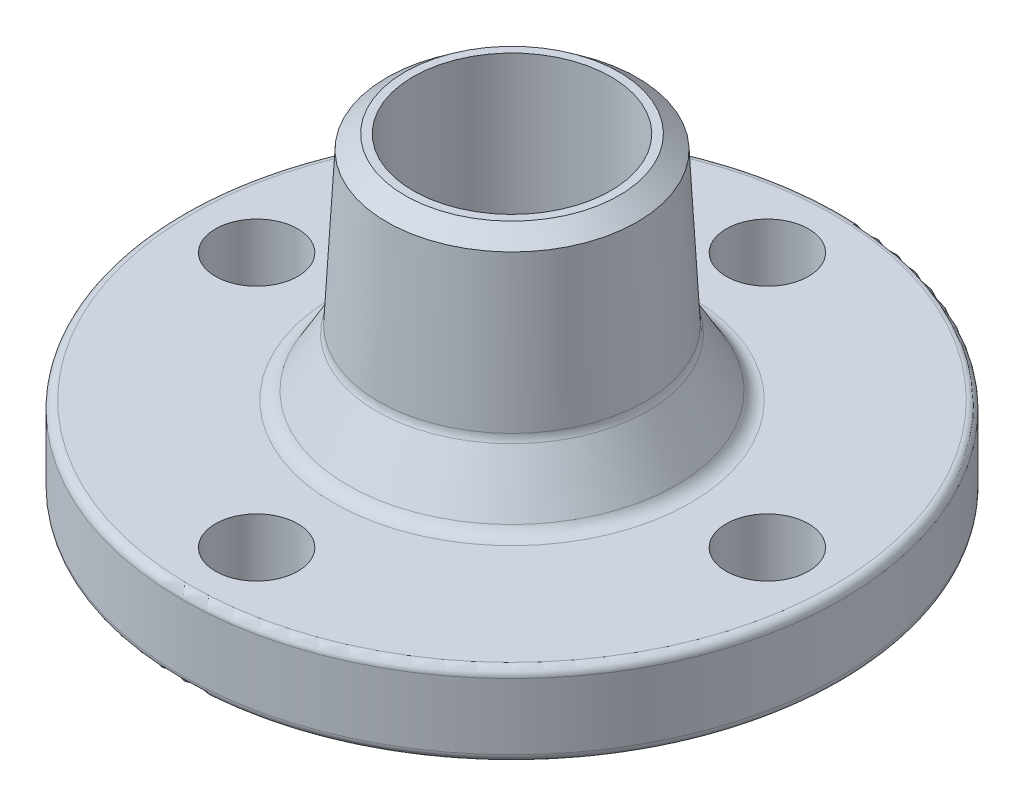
ISO-10303-21;
HEADER;
FILE_DESCRIPTION(('STEP AP214'),'2;1');
FILE_NAME('part.step','',(''),(''),'','','');
FILE_SCHEMA(('AUTOMOTIVE_DESIGN { 1 0 10303 214 1 1 1 1 }'));
ENDSEC;
DATA;
#1=APPLICATION_CONTEXT('core data for automotive mechanical design processes');
#2=APPLICATION_PROTOCOL_DEFINITION('international standard','automotive_design',2000,#1);
#3=PRODUCT_CONTEXT('',#1,'mechanical');
#4=PRODUCT('Part','Part','',(#3));
#5=PRODUCT_RELATED_PRODUCT_CATEGORY('part','',(#4));
#6=PRODUCT_DEFINITION_FORMATION('','',#4);
#7=PRODUCT_DEFINITION_CONTEXT('part definition',#1,'design');
#8=PRODUCT_DEFINITION('design','',#6,#7);
#9=PRODUCT_DEFINITION_SHAPE('','',#8);
#10=(LENGTH_UNIT() NAMED_UNIT(*) SI_UNIT(.MILLI.,.METRE.));
#11=(NAMED_UNIT(*) PLANE_ANGLE_UNIT() SI_UNIT($,.RADIAN.));
#12=(NAMED_UNIT(*) SI_UNIT($,.STERADIAN.) SOLID_ANGLE_UNIT());
#13=UNCERTAINTY_MEASURE_WITH_UNIT(LENGTH_MEASURE(1.E-05),#10,'distance_accuracy_value','');
#14=(GEOMETRIC_REPRESENTATION_CONTEXT(3) GLOBAL_UNCERTAINTY_ASSIGNED_CONTEXT((#13)) GLOBAL_UNIT_ASSIGNED_CONTEXT((#10,
#11,#12)) REPRESENTATION_CONTEXT('',''));
#15=CARTESIAN_POINT('',(0.,0.,0.));
#16=DIRECTION('',(0.,0.,1.));
#17=DIRECTION('',(1.,0.,0.));
#18=AXIS2_PLACEMENT_3D('',#15,#16,#17);
#19=CARTESIAN_POINT('',(19.05,0.,0.));
#20=DIRECTION('',(0.,1.,0.));
#21=DIRECTION('',(-1.,0.,0.));
#22=AXIS2_PLACEMENT_3D('',#19,#20,#21);
#23=PLANE('',#22);
#24=CARTESIAN_POINT('',(0.,0.,0.));
#25=DIRECTION('',(0.,1.,0.));
#26=DIRECTION('',(-1.,0.,0.));
#27=AXIS2_PLACEMENT_3D('',#24,#25,#26);
#28=CIRCLE('',#27,36.5125);
#29=CARTESIAN_POINT('',(-36.5125,0.,0.));
#30=VERTEX_POINT('',#29);
#31=EDGE_CURVE('E66',#30,#30,#28,.T.);
#32=ORIENTED_EDGE('',*,*,#31,.F.);
#33=EDGE_LOOP('',(#32));
#34=FACE_BOUND('',#33,.T.);
#35=CARTESIAN_POINT('',(0.,0.,0.));
#36=DIRECTION('',(0.,1.,0.));
#37=DIRECTION('',(-1.,0.,0.));
#38=AXIS2_PLACEMENT_3D('',#35,#36,#37);
#39=CIRCLE('',#38,19.05);
#40=CARTESIAN_POINT('',(-19.05,0.,0.));
#41=VERTEX_POINT('',#40);
#42=EDGE_CURVE('E70',#41,#41,#39,.T.);
#43=ORIENTED_EDGE('',*,*,#42,.T.);
#44=EDGE_LOOP('',(#43));
#45=FACE_BOUND('',#44,.T.);
#46=ADVANCED_FACE('F31',(#34,#45),#23,.F.);
#47=CARTESIAN_POINT('',(36.5125,1.5875,0.));
#48=DIRECTION('',(0.,1.,0.));
#49=DIRECTION('',(-1.,0.,0.));
#50=AXIS2_PLACEMENT_3D('',#47,#48,#49);
#51=PLANE('',#50);
#52=CARTESIAN_POINT('',(0.,1.58749999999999,0.));
#53=DIRECTION('',(0.,1.,0.));
#54=DIRECTION('',(-1.,0.,0.));
#55=AXIS2_PLACEMENT_3D('',#52,#53,#54);
#56=CIRCLE('',#55,38.1);
#57=CARTESIAN_POINT('',(-38.1,1.58749999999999,0.));
#58=VERTEX_POINT('',#57);
#59=EDGE_CURVE('E10',#58,#58,#56,.T.);
#60=ORIENTED_EDGE('',*,*,#59,.T.);
#61=EDGE_LOOP('',(#60));
#62=FACE_BOUND('',#61,.T.);
#63=CARTESIAN_POINT('',(0.,1.58749999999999,0.));
#64=DIRECTION('',(0.,1.,0.));
#65=DIRECTION('',(-1.,0.,0.));
#66=AXIS2_PLACEMENT_3D('',#63,#64,#65);
#67=CIRCLE('',#66,61.9125);
#68=CARTESIAN_POINT('',(-61.9125,1.58749999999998,0.));
#69=VERTEX_POINT('',#68);
#70=EDGE_CURVE('E38',#69,#69,#67,.F.);
#71=ORIENTED_EDGE('',*,*,#70,.T.);
#72=EDGE_LOOP('',(#71));
#73=FACE_BOUND('',#72,.T.);
#74=CARTESIAN_POINT('',(5.15251089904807E-13,1.58749999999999,-49.2125));
#75=DIRECTION('',(0.,-1.,0.));
#76=DIRECTION('',(0.,0.,-1.));
#77=AXIS2_PLACEMENT_3D('',#74,#75,#76);
#78=CIRCLE('',#77,7.9375);
#79=CARTESIAN_POINT('',(5.98392037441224E-13,1.58749999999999,-57.15));
#80=VERTEX_POINT('',#79);
#81=EDGE_CURVE('E102',#80,#80,#78,.T.);
#82=ORIENTED_EDGE('',*,*,#81,.F.);
#83=EDGE_LOOP('',(#82));
#84=FACE_BOUND('',#83,.T.);
#85=CARTESIAN_POINT('',(-49.2125,1.58749999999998,-3.43649249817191E-13));
#86=DIRECTION('',(0.,-1.,0.));
#87=DIRECTION('',(-1.,0.,0.));
#88=AXIS2_PLACEMENT_3D('',#85,#86,#87);
#89=CIRCLE('',#88,7.9375);
#90=CARTESIAN_POINT('',(-57.15,1.58749999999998,-3.99076548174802E-13));
#91=VERTEX_POINT('',#90);
#92=EDGE_CURVE('E96',#91,#91,#89,.T.);
#93=ORIENTED_EDGE('',*,*,#92,.F.);
#94=EDGE_LOOP('',(#93));
#95=FACE_BOUND('',#94,.T.);
#96=CARTESIAN_POINT('',(-1.72047409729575E-13,1.58749999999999,49.2125));
#97=DIRECTION('',(0.,-1.,0.));
#98=DIRECTION('',(0.,0.,1.));
#99=AXIS2_PLACEMENT_3D('',#96,#97,#98);
#100=CIRCLE('',#99,7.9375);
#101=CARTESIAN_POINT('',(-1.9976105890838E-13,1.58749999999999,57.15));
#102=VERTEX_POINT('',#101);
#103=EDGE_CURVE('E90',#102,#102,#100,.T.);
#104=ORIENTED_EDGE('',*,*,#103,.F.);
#105=EDGE_LOOP('',(#104));
#106=FACE_BOUND('',#105,.T.);
#107=CARTESIAN_POINT('',(49.2125,1.5875,0.));
#108=DIRECTION('',(0.,-1.,0.));
#109=DIRECTION('',(1.,0.,0.));
#110=AXIS2_PLACEMENT_3D('',#107,#108,#109);
#111=CIRCLE('',#110,7.9375);
#112=CARTESIAN_POINT('',(57.15,1.5875,0.));
#113=VERTEX_POINT('',#112);
#114=EDGE_CURVE('E71',#113,#113,#111,.T.);
#115=ORIENTED_EDGE('',*,*,#114,.F.);
#116=EDGE_LOOP('',(#115));
#117=FACE_BOUND('',#116,.T.);
#118=ADVANCED_FACE('F109',(#62,#73,#84,#95,#106,#117),#51,.F.);
#119=CARTESIAN_POINT('',(0.,61.9125,0.));
#120=DIRECTION('',(0.,1.,0.));
#121=DIRECTION('',(-1.,0.,0.));
#122=AXIS2_PLACEMENT_3D('',#119,#120,#121);
#123=CYLINDRICAL_SURFACE('',#122,63.5);
#124=CARTESIAN_POINT('',(0.,15.875,0.));
#125=DIRECTION('',(0.,-1.,0.));
#126=DIRECTION('',(1.,0.,0.));
#127=AXIS2_PLACEMENT_3D('',#124,#125,#126);
#128=CIRCLE('',#127,63.5);
#129=CARTESIAN_POINT('',(63.5,15.875,0.));
#130=VERTEX_POINT('',#129);
#131=EDGE_CURVE('E42',#130,#130,#128,.T.);
#132=ORIENTED_EDGE('',*,*,#131,.T.);
#133=EDGE_LOOP('',(#132));
#134=FACE_BOUND('',#133,.T.);
#135=CARTESIAN_POINT('',(0.,3.17499999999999,0.));
#136=DIRECTION('',(0.,1.,0.));
#137=DIRECTION('',(-1.,0.,0.));
#138=AXIS2_PLACEMENT_3D('',#135,#136,#137);
#139=CIRCLE('',#138,63.5);
#140=CARTESIAN_POINT('',(-63.5,3.17499999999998,0.));
#141=VERTEX_POINT('',#140);
#142=EDGE_CURVE('E46',#141,#141,#139,.T.);
#143=ORIENTED_EDGE('',*,*,#142,.T.);
#144=EDGE_LOOP('',(#143));
#145=FACE_BOUND('',#144,.T.);
#146=ADVANCED_FACE('F112',(#134,#145),#123,.T.);
#147=CARTESIAN_POINT('',(63.5,17.4625,0.));
#148=DIRECTION('',(0.,-1.,0.));
#149=DIRECTION('',(1.,0.,0.));
#150=AXIS2_PLACEMENT_3D('',#147,#148,#149);
#151=PLANE('',#150);
#152=CARTESIAN_POINT('',(0.,17.4625,0.));
#153=DIRECTION('',(0.,-1.,0.));
#154=DIRECTION('',(1.,0.,0.));
#155=AXIS2_PLACEMENT_3D('',#152,#153,#154);
#156=CIRCLE('',#155,61.9125);
#157=CARTESIAN_POINT('',(61.9125,17.4625,0.));
#158=VERTEX_POINT('',#157);
#159=EDGE_CURVE('E51',#158,#158,#156,.F.);
#160=ORIENTED_EDGE('',*,*,#159,.T.);
#161=EDGE_LOOP('',(#160));
#162=FACE_BOUND('',#161,.T.);
#163=CARTESIAN_POINT('',(0.,17.4625,0.));
#164=DIRECTION('',(0.,-1.,0.));
#165=DIRECTION('',(1.,0.,0.));
#166=AXIS2_PLACEMENT_3D('',#163,#164,#165);
#167=CIRCLE('',#166,34.3768371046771);
#168=CARTESIAN_POINT('',(34.3768371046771,17.4625,0.));
#169=VERTEX_POINT('',#168);
#170=EDGE_CURVE('E60',#169,#169,#167,.T.);
#171=ORIENTED_EDGE('',*,*,#170,.T.);
#172=EDGE_LOOP('',(#171));
#173=FACE_BOUND('',#172,.T.);
#174=CARTESIAN_POINT('',(5.13023241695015E-13,17.4625,-49.2125));
#175=DIRECTION('',(0.,-1.,0.));
#176=DIRECTION('',(0.,0.,-1.));
#177=AXIS2_PLACEMENT_3D('',#174,#175,#176);
#178=CIRCLE('',#177,7.9375);
#179=CARTESIAN_POINT('',(5.96164189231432E-13,17.4625,-57.15));
#180=VERTEX_POINT('',#179);
#181=EDGE_CURVE('E99',#180,#180,#178,.T.);
#182=ORIENTED_EDGE('',*,*,#181,.T.);
#183=EDGE_LOOP('',(#182));
#184=FACE_BOUND('',#183,.T.);
#185=CARTESIAN_POINT('',(-49.2125,17.4625,-3.43649249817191E-13));
#186=DIRECTION('',(0.,-1.,0.));
#187=DIRECTION('',(-1.,0.,0.));
#188=AXIS2_PLACEMENT_3D('',#185,#186,#187);
#189=CIRCLE('',#188,7.9375);
#190=CARTESIAN_POINT('',(-57.15,17.4625,-3.99076548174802E-13));
#191=VERTEX_POINT('',#190);
#192=EDGE_CURVE('E93',#191,#191,#189,.T.);
#193=ORIENTED_EDGE('',*,*,#192,.T.);
#194=EDGE_LOOP('',(#193));
#195=FACE_BOUND('',#194,.T.);
#196=CARTESIAN_POINT('',(-1.74275257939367E-13,17.4625,49.2125));
#197=DIRECTION('',(0.,-1.,0.));
#198=DIRECTION('',(0.,0.,1.));
#199=AXIS2_PLACEMENT_3D('',#196,#197,#198);
#200=CIRCLE('',#199,7.9375);
#201=CARTESIAN_POINT('',(-2.01988907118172E-13,17.4625,57.15));
#202=VERTEX_POINT('',#201);
#203=EDGE_CURVE('E87',#202,#202,#200,.T.);
#204=ORIENTED_EDGE('',*,*,#203,.T.);
#205=EDGE_LOOP('',(#204));
#206=FACE_BOUND('',#205,.T.);
#207=CARTESIAN_POINT('',(49.2125,17.4625,0.));
#208=DIRECTION('',(0.,-1.,0.));
#209=DIRECTION('',(1.,0.,0.));
#210=AXIS2_PLACEMENT_3D('',#207,#208,#209);
#211=CIRCLE('',#210,7.9375);
#212=CARTESIAN_POINT('',(57.15,17.4625,0.));
#213=VERTEX_POINT('',#212);
#214=EDGE_CURVE('E67',#213,#213,#211,.T.);
#215=ORIENTED_EDGE('',*,*,#214,.T.);
#216=EDGE_LOOP('',(#215));
#217=FACE_BOUND('',#216,.T.);
#218=ADVANCED_FACE('F128',(#162,#173,#184,#195,#206,#217),#151,.F.);
#219=CARTESIAN_POINT('',(0.,17.4625,0.));
#220=DIRECTION('',(0.,-1.,0.));
#221=DIRECTION('',(1.,0.,0.));
#222=AXIS2_PLACEMENT_3D('',#219,#220,#221);
#223=CONICAL_SURFACE('',#222,32.54375,0.523598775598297);
#224=CARTESIAN_POINT('',(0.,28.6266583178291,0.));
#225=DIRECTION('',(0.,-1.,0.));
#226=DIRECTION('',(1.,0.,0.));
#227=AXIS2_PLACEMENT_3D('',#224,#225,#226);
#228=CIRCLE('',#227,26.0981201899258);
#229=CARTESIAN_POINT('',(26.0981201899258,28.6266583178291,0.));
#230=VERTEX_POINT('',#229);
#231=EDGE_CURVE('E54',#230,#230,#228,.T.);
#232=ORIENTED_EDGE('',*,*,#231,.T.);
#233=EDGE_LOOP('',(#232));
#234=FACE_BOUND('',#233,.T.);
#235=CARTESIAN_POINT('',(0.,19.05,0.));
#236=DIRECTION('',(0.,-1.,0.));
#237=DIRECTION('',(1.,0.,0.));
#238=AXIS2_PLACEMENT_3D('',#235,#236,#237);
#239=CIRCLE('',#238,31.6272064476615);
#240=CARTESIAN_POINT('',(31.6272064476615,19.05,0.));
#241=VERTEX_POINT('',#240);
#242=EDGE_CURVE('E63',#241,#241,#239,.F.);
#243=ORIENTED_EDGE('',*,*,#242,.T.);
#244=EDGE_LOOP('',(#243));
#245=FACE_BOUND('',#244,.T.);
#246=ADVANCED_FACE('F130',(#234,#245),#223,.T.);
#247=CARTESIAN_POINT('',(0.,29.2859118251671,0.));
#248=DIRECTION('',(0.,-1.,0.));
#249=DIRECTION('',(1.,0.,0.));
#250=AXIS2_PLACEMENT_3D('',#247,#248,#249);
#251=CONICAL_SURFACE('',#250,25.7175,0.0529612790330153);
#252=CARTESIAN_POINT('',(0.,30.0460848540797,0.));
#253=DIRECTION('',(0.,-1.,0.));
#254=DIRECTION('',(1.,0.,0.));
#255=AXIS2_PLACEMENT_3D('',#252,#253,#254);
#256=CIRCLE('',#255,25.6772025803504);
#257=CARTESIAN_POINT('',(25.6772025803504,30.0460848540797,0.));
#258=VERTEX_POINT('',#257);
#259=EDGE_CURVE('E57',#258,#258,#256,.F.);
#260=ORIENTED_EDGE('',*,*,#259,.T.);
#261=EDGE_LOOP('',(#260));
#262=FACE_BOUND('',#261,.T.);
#263=CARTESIAN_POINT('',(0.,59.2326104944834,0.));
#264=DIRECTION('',(0.,1.,0.));
#265=DIRECTION('',(-1.,0.,0.));
#266=AXIS2_PLACEMENT_3D('',#263,#264,#265);
#267=CIRCLE('',#266,24.13);
#268=CARTESIAN_POINT('',(-24.13,59.2326104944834,0.));
#269=VERTEX_POINT('',#268);
#270=EDGE_CURVE('E74',#269,#269,#267,.T.);
#271=ORIENTED_EDGE('',*,*,#270,.F.);
#272=EDGE_LOOP('',(#271));
#273=FACE_BOUND('',#272,.T.);
#274=ADVANCED_FACE('F137',(#262,#273),#251,.T.);
#275=CARTESIAN_POINT('',(0.,59.2326104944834,0.));
#276=DIRECTION('',(0.,-1.,0.));
#277=DIRECTION('',(1.,0.,0.));
#278=AXIS2_PLACEMENT_3D('',#275,#276,#277);
#279=CONICAL_SURFACE('',#278,24.13,0.916297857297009);
#280=CARTESIAN_POINT('',(0.,61.9125,0.));
#281=DIRECTION('',(0.,1.,0.));
#282=DIRECTION('',(-1.,0.,0.));
#283=AXIS2_PLACEMENT_3D('',#280,#281,#282);
#284=CIRCLE('',#283,20.6375);
#285=CARTESIAN_POINT('',(-20.6375,61.9125,0.));
#286=VERTEX_POINT('',#285);
#287=EDGE_CURVE('E77',#286,#286,#284,.T.);
#288=ORIENTED_EDGE('',*,*,#287,.F.);
#289=EDGE_LOOP('',(#288));
#290=FACE_BOUND('',#289,.T.);
#291=ORIENTED_EDGE('',*,*,#270,.T.);
#292=EDGE_LOOP('',(#291));
#293=FACE_BOUND('',#292,.T.);
#294=ADVANCED_FACE('F219',(#290,#293),#279,.T.);
#295=CARTESIAN_POINT('',(20.6375,61.9125,0.));
#296=DIRECTION('',(0.,-1.,0.));
#297=DIRECTION('',(1.,0.,0.));
#298=AXIS2_PLACEMENT_3D('',#295,#296,#297);
#299=PLANE('',#298);
#300=CARTESIAN_POINT('',(0.,61.9125,0.));
#301=DIRECTION('',(0.,1.,0.));
#302=DIRECTION('',(-1.,0.,0.));
#303=AXIS2_PLACEMENT_3D('',#300,#301,#302);
#304=CIRCLE('',#303,19.05);
#305=CARTESIAN_POINT('',(-19.05,61.9125,0.));
#306=VERTEX_POINT('',#305);
#307=EDGE_CURVE('E80',#306,#306,#304,.T.);
#308=ORIENTED_EDGE('',*,*,#307,.F.);
#309=EDGE_LOOP('',(#308));
#310=FACE_BOUND('',#309,.T.);
#311=ORIENTED_EDGE('',*,*,#287,.T.);
#312=EDGE_LOOP('',(#311));
#313=FACE_BOUND('',#312,.T.);
#314=ADVANCED_FACE('F274',(#310,#313),#299,.F.);
#315=CARTESIAN_POINT('',(0.,61.9125,0.));
#316=DIRECTION('',(0.,1.,0.));
#317=DIRECTION('',(-1.,0.,0.));
#318=AXIS2_PLACEMENT_3D('',#315,#316,#317);
#319=CYLINDRICAL_SURFACE('',#318,19.05);
#320=ORIENTED_EDGE('',*,*,#42,.F.);
#321=EDGE_LOOP('',(#320));
#322=FACE_BOUND('',#321,.T.);
#323=ORIENTED_EDGE('',*,*,#307,.T.);
#324=EDGE_LOOP('',(#323));
#325=FACE_BOUND('',#324,.T.);
#326=ADVANCED_FACE('F124',(#322,#325),#319,.F.);
#327=CARTESIAN_POINT('',(49.2125,61.9125,0.));
#328=DIRECTION('',(0.,-1.,0.));
#329=DIRECTION('',(1.,0.,0.));
#330=AXIS2_PLACEMENT_3D('',#327,#328,#329);
#331=CYLINDRICAL_SURFACE('',#330,7.9375);
#332=CARTESIAN_POINT('',(57.15,1.5875,0.));
#333=CARTESIAN_POINT('',(57.15,1.75286458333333,0.));
#334=CARTESIAN_POINT('',(57.15,1.91822916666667,0.));
#335=CARTESIAN_POINT('',(57.15,2.24895833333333,0.));
#336=CARTESIAN_POINT('',(57.15,2.41432291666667,0.));
#337=CARTESIAN_POINT('',(57.15,2.74505208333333,0.));
#338=CARTESIAN_POINT('',(57.15,2.91041666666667,0.));
#339=CARTESIAN_POINT('',(57.15,3.24114583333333,0.));
#340=CARTESIAN_POINT('',(57.15,3.40651041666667,0.));
#341=CARTESIAN_POINT('',(57.15,3.73723958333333,0.));
#342=CARTESIAN_POINT('',(57.15,3.90260416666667,0.));
#343=CARTESIAN_POINT('',(57.15,4.23333333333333,0.));
#344=CARTESIAN_POINT('',(57.15,4.39869791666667,0.));
#345=CARTESIAN_POINT('',(57.15,4.72942708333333,0.));
#346=CARTESIAN_POINT('',(57.15,4.89479166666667,0.));
#347=CARTESIAN_POINT('',(57.15,5.22552083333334,0.));
#348=CARTESIAN_POINT('',(57.15,5.39088541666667,0.));
#349=CARTESIAN_POINT('',(57.15,5.72161458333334,0.));
#350=CARTESIAN_POINT('',(57.15,5.88697916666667,0.));
#351=CARTESIAN_POINT('',(57.15,6.21770833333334,0.));
#352=CARTESIAN_POINT('',(57.15,6.38307291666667,0.));
#353=CARTESIAN_POINT('',(57.15,6.71380208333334,0.));
#354=CARTESIAN_POINT('',(57.15,6.87916666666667,0.));
#355=CARTESIAN_POINT('',(57.15,7.20989583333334,0.));
#356=CARTESIAN_POINT('',(57.15,7.37526041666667,0.));
#357=CARTESIAN_POINT('',(57.15,7.70598958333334,0.));
#358=CARTESIAN_POINT('',(57.15,7.87135416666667,0.));
#359=CARTESIAN_POINT('',(57.15,8.20208333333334,0.));
#360=CARTESIAN_POINT('',(57.15,8.36744791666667,0.));
#361=CARTESIAN_POINT('',(57.15,8.69817708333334,0.));
#362=CARTESIAN_POINT('',(57.15,8.86354166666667,0.));
#363=CARTESIAN_POINT('',(57.15,9.19427083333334,0.));
#364=CARTESIAN_POINT('',(57.15,9.35963541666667,0.));
#365=CARTESIAN_POINT('',(57.15,9.69036458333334,0.));
#366=CARTESIAN_POINT('',(57.15,9.85572916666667,0.));
#367=CARTESIAN_POINT('',(57.15,10.1864583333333,0.));
#368=CARTESIAN_POINT('',(57.15,10.3518229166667,0.));
#369=CARTESIAN_POINT('',(57.15,10.6825520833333,0.));
#370=CARTESIAN_POINT('',(57.15,10.8479166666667,0.));
#371=CARTESIAN_POINT('',(57.15,11.1786458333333,0.));
#372=CARTESIAN_POINT('',(57.15,11.3440104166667,0.));
#373=CARTESIAN_POINT('',(57.15,11.6747395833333,0.));
#374=CARTESIAN_POINT('',(57.15,11.8401041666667,0.));
#375=CARTESIAN_POINT('',(57.15,12.1708333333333,0.));
#376=CARTESIAN_POINT('',(57.15,12.3361979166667,0.));
#377=CARTESIAN_POINT('',(57.15,12.6669270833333,0.));
#378=CARTESIAN_POINT('',(57.15,12.8322916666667,0.));
#379=CARTESIAN_POINT('',(57.15,13.1630208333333,0.));
#380=CARTESIAN_POINT('',(57.15,13.3283854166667,0.));
#381=CARTESIAN_POINT('',(57.15,13.6591145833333,0.));
#382=CARTESIAN_POINT('',(57.15,13.8244791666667,0.));
#383=CARTESIAN_POINT('',(57.15,14.1552083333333,0.));
#384=CARTESIAN_POINT('',(57.15,14.3205729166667,0.));
#385=CARTESIAN_POINT('',(57.15,14.6513020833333,0.));
#386=CARTESIAN_POINT('',(57.15,14.8166666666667,0.));
#387=CARTESIAN_POINT('',(57.15,15.1473958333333,0.));
#388=CARTESIAN_POINT('',(57.15,15.3127604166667,0.));
#389=CARTESIAN_POINT('',(57.15,15.6434895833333,0.));
#390=CARTESIAN_POINT('',(57.15,15.8088541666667,0.));
#391=CARTESIAN_POINT('',(57.15,16.1395833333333,0.));
#392=CARTESIAN_POINT('',(57.15,16.3049479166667,0.));
#393=CARTESIAN_POINT('',(57.15,16.6356770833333,0.));
#394=CARTESIAN_POINT('',(57.15,16.8010416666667,0.));
#395=CARTESIAN_POINT('',(57.15,17.1317708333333,0.));
#396=CARTESIAN_POINT('',(57.15,17.2971354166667,0.));
#397=CARTESIAN_POINT('',(57.15,17.4625,0.));
#398=B_SPLINE_CURVE_WITH_KNOTS('',3,(#332,#333,#334,#335,#336,#337,#338,#339,#340,#341,#342,
#343,#344,#345,#346,#347,#348,#349,#350,#351,#352,#353,#354,#355,#356,#357,#358,#359,#360,#361,
#362,#363,#364,#365,#366,#367,#368,#369,#370,#371,#372,#373,#374,#375,#376,#377,#378,#379,#380,
#381,#382,#383,#384,#385,#386,#387,#388,#389,#390,#391,#392,#393,#394,#395,#396,#397),
.UNSPECIFIED.,.F.,.F.,(4,2,2,2,2,2,2,2,2,2,2,2,2,2,2,2,2,2,2,2,2,2,2,2,2,2,2,2,2,2,2,2,4),(0.,
0.496093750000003,0.992187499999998,1.48828125,1.984375,2.48046875,2.9765625,3.47265625,
3.96875000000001,4.46484375,4.96093750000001,5.45703125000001,5.953125,6.44921875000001,
6.94531250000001,7.44140625,7.93750000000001,8.43359375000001,8.92968750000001,9.42578125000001,
9.92187500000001,10.41796875,10.9140625,11.41015625,11.90625,12.40234375,12.8984375,13.39453125,
13.890625,14.38671875,14.8828125,15.37890625,15.875),.UNSPECIFIED.);
#399=EDGE_CURVE('BSEAM120',#113,#213,#398,.T.);
#400=ORIENTED_EDGE('',*,*,#114,.T.);
#401=ORIENTED_EDGE('',*,*,#214,.F.);
#402=ORIENTED_EDGE('',*,*,#399,.T.);
#403=ORIENTED_EDGE('',*,*,#399,.F.);
#404=EDGE_LOOP('',(#400,#402,#401,#403));
#405=FACE_BOUND('',#404,.T.);
#406=ADVANCED_FACE('F120',(#405),#331,.F.);
#407=CARTESIAN_POINT('',(-1.80513232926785E-13,61.9125,49.2125));
#408=DIRECTION('',(0.,-1.,0.));
#409=DIRECTION('',(0.,0.,1.));
#410=AXIS2_PLACEMENT_3D('',#407,#408,#409);
#411=CYLINDRICAL_SURFACE('',#410,7.9375);
#412=CARTESIAN_POINT('',(-1.9976105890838E-13,1.58749999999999,57.15));
#413=CARTESIAN_POINT('',(-1.99784265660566E-13,1.75286458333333,57.15));
#414=CARTESIAN_POINT('',(-1.99807472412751E-13,1.91822916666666,57.15));
#415=CARTESIAN_POINT('',(-1.99853885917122E-13,2.24895833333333,57.15));
#416=CARTESIAN_POINT('',(-1.99877092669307E-13,2.41432291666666,57.15));
#417=CARTESIAN_POINT('',(-1.99923506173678E-13,2.74505208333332,57.15));
#418=CARTESIAN_POINT('',(-1.99946712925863E-13,2.91041666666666,57.15));
#419=CARTESIAN_POINT('',(-1.99993126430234E-13,3.24114583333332,57.15));
#420=CARTESIAN_POINT('',(-2.00016333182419E-13,3.40651041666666,57.15));
#421=CARTESIAN_POINT('',(-2.0006274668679E-13,3.73723958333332,57.15));
#422=CARTESIAN_POINT('',(-2.00085953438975E-13,3.90260416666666,57.15));
#423=CARTESIAN_POINT('',(-2.00132366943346E-13,4.23333333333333,57.15));
#424=CARTESIAN_POINT('',(-2.00155573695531E-13,4.39869791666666,57.15));
#425=CARTESIAN_POINT('',(-2.00201987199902E-13,4.72942708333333,57.15));
#426=CARTESIAN_POINT('',(-2.00225193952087E-13,4.89479166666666,57.15));
#427=CARTESIAN_POINT('',(-2.00271607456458E-13,5.22552083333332,57.15));
#428=CARTESIAN_POINT('',(-2.00294814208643E-13,5.39088541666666,57.15));
#429=CARTESIAN_POINT('',(-2.00341227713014E-13,5.72161458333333,57.15));
#430=CARTESIAN_POINT('',(-2.00364434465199E-13,5.88697916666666,57.15));
#431=CARTESIAN_POINT('',(-2.0041084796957E-13,6.21770833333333,57.15));
#432=CARTESIAN_POINT('',(-2.00434054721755E-13,6.38307291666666,57.15));
#433=CARTESIAN_POINT('',(-2.00480468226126E-13,6.71380208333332,57.15));
#434=CARTESIAN_POINT('',(-2.00503674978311E-13,6.87916666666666,57.15));
#435=CARTESIAN_POINT('',(-2.00550088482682E-13,7.20989583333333,57.15));
#436=CARTESIAN_POINT('',(-2.00573295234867E-13,7.37526041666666,57.15));
#437=CARTESIAN_POINT('',(-2.00619708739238E-13,7.70598958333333,57.15));
#438=CARTESIAN_POINT('',(-2.00642915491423E-13,7.87135416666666,57.15));
#439=CARTESIAN_POINT('',(-2.00689328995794E-13,8.20208333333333,57.15));
#440=CARTESIAN_POINT('',(-2.00712535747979E-13,8.36744791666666,57.15));
#441=CARTESIAN_POINT('',(-2.0075894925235E-13,8.69817708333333,57.15));
#442=CARTESIAN_POINT('',(-2.00782156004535E-13,8.86354166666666,57.15));
#443=CARTESIAN_POINT('',(-2.00828569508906E-13,9.19427083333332,57.15));
#444=CARTESIAN_POINT('',(-2.00851776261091E-13,9.35963541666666,57.15));
#445=CARTESIAN_POINT('',(-2.00898189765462E-13,9.69036458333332,57.15));
#446=CARTESIAN_POINT('',(-2.00921396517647E-13,9.85572916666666,57.15));
#447=CARTESIAN_POINT('',(-2.00967810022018E-13,10.1864583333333,57.15));
#448=CARTESIAN_POINT('',(-2.00991016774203E-13,10.3518229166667,57.15));
#449=CARTESIAN_POINT('',(-2.01037430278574E-13,10.6825520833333,57.15));
#450=CARTESIAN_POINT('',(-2.01060637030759E-13,10.8479166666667,57.15));
#451=CARTESIAN_POINT('',(-2.0110705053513E-13,11.1786458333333,57.15));
#452=CARTESIAN_POINT('',(-2.01130257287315E-13,11.3440104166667,57.15));
#453=CARTESIAN_POINT('',(-2.01176670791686E-13,11.6747395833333,57.15));
#454=CARTESIAN_POINT('',(-2.01199877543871E-13,11.8401041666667,57.15));
#455=CARTESIAN_POINT('',(-2.01246291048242E-13,12.1708333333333,57.15));
#456=CARTESIAN_POINT('',(-2.01269497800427E-13,12.3361979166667,57.15));
#457=CARTESIAN_POINT('',(-2.01315911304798E-13,12.6669270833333,57.15));
#458=CARTESIAN_POINT('',(-2.01339118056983E-13,12.8322916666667,57.15));
#459=CARTESIAN_POINT('',(-2.01385531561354E-13,13.1630208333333,57.15));
#460=CARTESIAN_POINT('',(-2.01408738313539E-13,13.3283854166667,57.15));
#461=CARTESIAN_POINT('',(-2.0145515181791E-13,13.6591145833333,57.15));
#462=CARTESIAN_POINT('',(-2.01478358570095E-13,13.8244791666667,57.15));
#463=CARTESIAN_POINT('',(-2.01524772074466E-13,14.1552083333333,57.15));
#464=CARTESIAN_POINT('',(-2.01547978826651E-13,14.3205729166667,57.15));
#465=CARTESIAN_POINT('',(-2.01594392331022E-13,14.6513020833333,57.15));
#466=CARTESIAN_POINT('',(-2.01617599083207E-13,14.8166666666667,57.15));
#467=CARTESIAN_POINT('',(-2.01664012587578E-13,15.1473958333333,57.15));
#468=CARTESIAN_POINT('',(-2.01687219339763E-13,15.3127604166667,57.15));
#469=CARTESIAN_POINT('',(-2.01733632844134E-13,15.6434895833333,57.15));
#470=CARTESIAN_POINT('',(-2.01756839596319E-13,15.8088541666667,57.15));
#471=CARTESIAN_POINT('',(-2.0180325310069E-13,16.1395833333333,57.15));
#472=CARTESIAN_POINT('',(-2.01826459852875E-13,16.3049479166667,57.15));
#473=CARTESIAN_POINT('',(-2.01872873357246E-13,16.6356770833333,57.15));
#474=CARTESIAN_POINT('',(-2.01896080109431E-13,16.8010416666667,57.15));
#475=CARTESIAN_POINT('',(-2.01942493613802E-13,17.1317708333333,57.15));
#476=CARTESIAN_POINT('',(-2.01965700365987E-13,17.2971354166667,57.15));
#477=CARTESIAN_POINT('',(-2.01988907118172E-13,17.4625,57.15));
#478=B_SPLINE_CURVE_WITH_KNOTS('',3,(#412,#413,#414,#415,#416,#417,#418,#419,#420,#421,#422,
#423,#424,#425,#426,#427,#428,#429,#430,#431,#432,#433,#434,#435,#436,#437,#438,#439,#440,#441,
#442,#443,#444,#445,#446,#447,#448,#449,#450,#451,#452,#453,#454,#455,#456,#457,#458,#459,#460,
#461,#462,#463,#464,#465,#466,#467,#468,#469,#470,#471,#472,#473,#474,#475,#476,#477),
.UNSPECIFIED.,.F.,.F.,(4,2,2,2,2,2,2,2,2,2,2,2,2,2,2,2,2,2,2,2,2,2,2,2,2,2,2,2,2,2,2,2,4),(0.,
0.496093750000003,0.992187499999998,1.48828125,1.984375,2.48046875,2.9765625,3.47265625,3.96875,
4.46484375,4.9609375,5.45703125,5.953125,6.44921875,6.9453125,7.44140625,7.9375,8.43359375,
8.9296875,9.42578125,9.921875,10.41796875,10.9140625,11.41015625,11.90625,12.40234375,
12.8984375,13.39453125,13.890625,14.38671875,14.8828125,15.37890625,15.875),.UNSPECIFIED.);
#479=EDGE_CURVE('BSEAM123',#102,#202,#478,.T.);
#480=ORIENTED_EDGE('',*,*,#103,.T.);
#481=ORIENTED_EDGE('',*,*,#203,.F.);
#482=ORIENTED_EDGE('',*,*,#479,.T.);
#483=ORIENTED_EDGE('',*,*,#479,.F.);
#484=EDGE_LOOP('',(#480,#482,#481,#483));
#485=FACE_BOUND('',#484,.T.);
#486=ADVANCED_FACE('F123',(#485),#411,.F.);
#487=CARTESIAN_POINT('',(-49.2125,61.9125,-3.43649249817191E-13));
#488=DIRECTION('',(0.,-1.,0.));
#489=DIRECTION('',(-1.,0.,0.));
#490=AXIS2_PLACEMENT_3D('',#487,#488,#489);
#491=CYLINDRICAL_SURFACE('',#490,7.9375);
#492=CARTESIAN_POINT('',(-57.15,1.58749999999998,-3.99076548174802E-13));
#493=CARTESIAN_POINT('',(-57.15,1.75286458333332,-3.99076548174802E-13));
#494=CARTESIAN_POINT('',(-57.15,1.91822916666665,-3.99076548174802E-13));
#495=CARTESIAN_POINT('',(-57.15,2.24895833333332,-3.99076548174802E-13));
#496=CARTESIAN_POINT('',(-57.15,2.41432291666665,-3.99076548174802E-13));
#497=CARTESIAN_POINT('',(-57.15,2.74505208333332,-3.99076548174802E-13));
#498=CARTESIAN_POINT('',(-57.15,2.91041666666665,-3.99076548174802E-13));
#499=CARTESIAN_POINT('',(-57.15,3.24114583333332,-3.99076548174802E-13));
#500=CARTESIAN_POINT('',(-57.15,3.40651041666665,-3.99076548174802E-13));
#501=CARTESIAN_POINT('',(-57.15,3.73723958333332,-3.99076548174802E-13));
#502=CARTESIAN_POINT('',(-57.15,3.90260416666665,-3.99076548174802E-13));
#503=CARTESIAN_POINT('',(-57.15,4.23333333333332,-3.99076548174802E-13));
#504=CARTESIAN_POINT('',(-57.15,4.39869791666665,-3.99076548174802E-13));
#505=CARTESIAN_POINT('',(-57.15,4.72942708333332,-3.99076548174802E-13));
#506=CARTESIAN_POINT('',(-57.15,4.89479166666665,-3.99076548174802E-13));
#507=CARTESIAN_POINT('',(-57.15,5.22552083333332,-3.99076548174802E-13));
#508=CARTESIAN_POINT('',(-57.15,5.39088541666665,-3.99076548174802E-13));
#509=CARTESIAN_POINT('',(-57.15,5.72161458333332,-3.99076548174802E-13));
#510=CARTESIAN_POINT('',(-57.15,5.88697916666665,-3.99076548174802E-13));
#511=CARTESIAN_POINT('',(-57.15,6.21770833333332,-3.99076548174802E-13));
#512=CARTESIAN_POINT('',(-57.15,6.38307291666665,-3.99076548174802E-13));
#513=CARTESIAN_POINT('',(-57.15,6.71380208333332,-3.99076548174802E-13));
#514=CARTESIAN_POINT('',(-57.15,6.87916666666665,-3.99076548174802E-13));
#515=CARTESIAN_POINT('',(-57.15,7.20989583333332,-3.99076548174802E-13));
#516=CARTESIAN_POINT('',(-57.15,7.37526041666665,-3.99076548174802E-13));
#517=CARTESIAN_POINT('',(-57.15,7.70598958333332,-3.99076548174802E-13));
#518=CARTESIAN_POINT('',(-57.15,7.87135416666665,-3.99076548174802E-13));
#519=CARTESIAN_POINT('',(-57.15,8.20208333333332,-3.99076548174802E-13));
#520=CARTESIAN_POINT('',(-57.15,8.36744791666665,-3.99076548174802E-13));
#521=CARTESIAN_POINT('',(-57.15,8.69817708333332,-3.99076548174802E-13));
#522=CARTESIAN_POINT('',(-57.15,8.86354166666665,-3.99076548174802E-13));
#523=CARTESIAN_POINT('',(-57.15,9.19427083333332,-3.99076548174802E-13));
#524=CARTESIAN_POINT('',(-57.15,9.35963541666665,-3.99076548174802E-13));
#525=CARTESIAN_POINT('',(-57.15,9.69036458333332,-3.99076548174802E-13));
#526=CARTESIAN_POINT('',(-57.15,9.85572916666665,-3.99076548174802E-13));
#527=CARTESIAN_POINT('',(-57.15,10.1864583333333,-3.99076548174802E-13));
#528=CARTESIAN_POINT('',(-57.15,10.3518229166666,-3.99076548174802E-13));
#529=CARTESIAN_POINT('',(-57.15,10.6825520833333,-3.99076548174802E-13));
#530=CARTESIAN_POINT('',(-57.15,10.8479166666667,-3.99076548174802E-13));
#531=CARTESIAN_POINT('',(-57.15,11.1786458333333,-3.99076548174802E-13));
#532=CARTESIAN_POINT('',(-57.15,11.3440104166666,-3.99076548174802E-13));
#533=CARTESIAN_POINT('',(-57.15,11.6747395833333,-3.99076548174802E-13));
#534=CARTESIAN_POINT('',(-57.15,11.8401041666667,-3.99076548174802E-13));
#535=CARTESIAN_POINT('',(-57.15,12.1708333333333,-3.99076548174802E-13));
#536=CARTESIAN_POINT('',(-57.15,12.3361979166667,-3.99076548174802E-13));
#537=CARTESIAN_POINT('',(-57.15,12.6669270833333,-3.99076548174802E-13));
#538=CARTESIAN_POINT('',(-57.15,12.8322916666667,-3.99076548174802E-13));
#539=CARTESIAN_POINT('',(-57.15,13.1630208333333,-3.99076548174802E-13));
#540=CARTESIAN_POINT('',(-57.15,13.3283854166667,-3.99076548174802E-13));
#541=CARTESIAN_POINT('',(-57.15,13.6591145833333,-3.99076548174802E-13));
#542=CARTESIAN_POINT('',(-57.15,13.8244791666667,-3.99076548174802E-13));
#543=CARTESIAN_POINT('',(-57.15,14.1552083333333,-3.99076548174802E-13));
#544=CARTESIAN_POINT('',(-57.15,14.3205729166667,-3.99076548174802E-13));
#545=CARTESIAN_POINT('',(-57.15,14.6513020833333,-3.99076548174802E-13));
#546=CARTESIAN_POINT('',(-57.15,14.8166666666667,-3.99076548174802E-13));
#547=CARTESIAN_POINT('',(-57.15,15.1473958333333,-3.99076548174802E-13));
#548=CARTESIAN_POINT('',(-57.15,15.3127604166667,-3.99076548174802E-13));
#549=CARTESIAN_POINT('',(-57.15,15.6434895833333,-3.99076548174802E-13));
#550=CARTESIAN_POINT('',(-57.15,15.8088541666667,-3.99076548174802E-13));
#551=CARTESIAN_POINT('',(-57.15,16.1395833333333,-3.99076548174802E-13));
#552=CARTESIAN_POINT('',(-57.15,16.3049479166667,-3.99076548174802E-13));
#553=CARTESIAN_POINT('',(-57.15,16.6356770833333,-3.99076548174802E-13));
#554=CARTESIAN_POINT('',(-57.15,16.8010416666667,-3.99076548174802E-13));
#555=CARTESIAN_POINT('',(-57.15,17.1317708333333,-3.99076548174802E-13));
#556=CARTESIAN_POINT('',(-57.15,17.2971354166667,-3.99076548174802E-13));
#557=CARTESIAN_POINT('',(-57.15,17.4625,-3.99076548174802E-13));
#558=B_SPLINE_CURVE_WITH_KNOTS('',3,(#492,#493,#494,#495,#496,#497,#498,#499,#500,#501,#502,
#503,#504,#505,#506,#507,#508,#509,#510,#511,#512,#513,#514,#515,#516,#517,#518,#519,#520,#521,
#522,#523,#524,#525,#526,#527,#528,#529,#530,#531,#532,#533,#534,#535,#536,#537,#538,#539,#540,
#541,#542,#543,#544,#545,#546,#547,#548,#549,#550,#551,#552,#553,#554,#555,#556,#557),
.UNSPECIFIED.,.F.,.F.,(4,2,2,2,2,2,2,2,2,2,2,2,2,2,2,2,2,2,2,2,2,2,2,2,2,2,2,2,2,2,2,2,4),(0.,
0.496093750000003,0.992187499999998,1.48828125,1.984375,2.48046875,2.9765625,3.47265625,3.96875,
4.46484375,4.9609375,5.45703125,5.953125,6.44921875,6.9453125,7.44140625,7.9375,8.43359375,
8.9296875,9.42578125,9.921875,10.41796875,10.9140625,11.41015625,11.90625,12.40234375,
12.8984375,13.39453125,13.890625,14.38671875,14.8828125,15.37890625,15.875),.UNSPECIFIED.);
#559=EDGE_CURVE('BSEAM241',#91,#191,#558,.T.);
#560=ORIENTED_EDGE('',*,*,#92,.T.);
#561=ORIENTED_EDGE('',*,*,#192,.F.);
#562=ORIENTED_EDGE('',*,*,#559,.T.);
#563=ORIENTED_EDGE('',*,*,#559,.F.);
#564=EDGE_LOOP('',(#560,#562,#561,#563));
#565=FACE_BOUND('',#564,.T.);
#566=ADVANCED_FACE('F241',(#565),#491,.F.);
#567=CARTESIAN_POINT('',(5.06785266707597E-13,61.9125,-49.2125));
#568=DIRECTION('',(0.,-1.,0.));
#569=DIRECTION('',(0.,0.,-1.));
#570=AXIS2_PLACEMENT_3D('',#567,#568,#569);
#571=CYLINDRICAL_SURFACE('',#570,7.9375);
#572=CARTESIAN_POINT('',(5.98392037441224E-13,1.58749999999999,-57.15));
#573=CARTESIAN_POINT('',(5.98368830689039E-13,1.75286458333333,-57.15));
#574=CARTESIAN_POINT('',(5.98345623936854E-13,1.91822916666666,-57.15));
#575=CARTESIAN_POINT('',(5.98299210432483E-13,2.24895833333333,-57.15));
#576=CARTESIAN_POINT('',(5.98276003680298E-13,2.41432291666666,-57.15));
#577=CARTESIAN_POINT('',(5.98229590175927E-13,2.74505208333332,-57.15));
#578=CARTESIAN_POINT('',(5.98206383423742E-13,2.91041666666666,-57.15));
#579=CARTESIAN_POINT('',(5.98159969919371E-13,3.24114583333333,-57.15));
#580=CARTESIAN_POINT('',(5.98136763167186E-13,3.40651041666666,-57.15));
#581=CARTESIAN_POINT('',(5.98090349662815E-13,3.73723958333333,-57.15));
#582=CARTESIAN_POINT('',(5.9806714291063E-13,3.90260416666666,-57.15));
#583=CARTESIAN_POINT('',(5.98020729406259E-13,4.23333333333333,-57.15));
#584=CARTESIAN_POINT('',(5.97997522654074E-13,4.39869791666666,-57.15));
#585=CARTESIAN_POINT('',(5.97951109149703E-13,4.72942708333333,-57.15));
#586=CARTESIAN_POINT('',(5.97927902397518E-13,4.89479166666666,-57.15));
#587=CARTESIAN_POINT('',(5.97881488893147E-13,5.22552083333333,-57.15));
#588=CARTESIAN_POINT('',(5.97858282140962E-13,5.39088541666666,-57.15));
#589=CARTESIAN_POINT('',(5.97811868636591E-13,5.72161458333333,-57.15));
#590=CARTESIAN_POINT('',(5.97788661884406E-13,5.88697916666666,-57.15));
#591=CARTESIAN_POINT('',(5.97742248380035E-13,6.21770833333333,-57.15));
#592=CARTESIAN_POINT('',(5.9771904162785E-13,6.38307291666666,-57.15));
#593=CARTESIAN_POINT('',(5.97672628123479E-13,6.71380208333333,-57.15));
#594=CARTESIAN_POINT('',(5.97649421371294E-13,6.87916666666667,-57.15));
#595=CARTESIAN_POINT('',(5.97603007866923E-13,7.20989583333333,-57.15));
#596=CARTESIAN_POINT('',(5.97579801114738E-13,7.37526041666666,-57.15));
#597=CARTESIAN_POINT('',(5.97533387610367E-13,7.70598958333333,-57.15));
#598=CARTESIAN_POINT('',(5.97510180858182E-13,7.87135416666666,-57.15));
#599=CARTESIAN_POINT('',(5.97463767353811E-13,8.20208333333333,-57.15));
#600=CARTESIAN_POINT('',(5.97440560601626E-13,8.36744791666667,-57.15));
#601=CARTESIAN_POINT('',(5.97394147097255E-13,8.69817708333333,-57.15));
#602=CARTESIAN_POINT('',(5.9737094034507E-13,8.86354166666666,-57.15));
#603=CARTESIAN_POINT('',(5.97324526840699E-13,9.19427083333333,-57.15));
#604=CARTESIAN_POINT('',(5.97301320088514E-13,9.35963541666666,-57.15));
#605=CARTESIAN_POINT('',(5.97254906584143E-13,9.69036458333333,-57.15));
#606=CARTESIAN_POINT('',(5.97231699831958E-13,9.85572916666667,-57.15));
#607=CARTESIAN_POINT('',(5.97185286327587E-13,10.1864583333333,-57.15));
#608=CARTESIAN_POINT('',(5.97162079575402E-13,10.3518229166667,-57.15));
#609=CARTESIAN_POINT('',(5.97115666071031E-13,10.6825520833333,-57.15));
#610=CARTESIAN_POINT('',(5.97092459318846E-13,10.8479166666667,-57.15));
#611=CARTESIAN_POINT('',(5.97046045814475E-13,11.1786458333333,-57.15));
#612=CARTESIAN_POINT('',(5.9702283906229E-13,11.3440104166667,-57.15));
#613=CARTESIAN_POINT('',(5.96976425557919E-13,11.6747395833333,-57.15));
#614=CARTESIAN_POINT('',(5.96953218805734E-13,11.8401041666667,-57.15));
#615=CARTESIAN_POINT('',(5.96906805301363E-13,12.1708333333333,-57.15));
#616=CARTESIAN_POINT('',(5.96883598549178E-13,12.3361979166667,-57.15));
#617=CARTESIAN_POINT('',(5.96837185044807E-13,12.6669270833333,-57.15));
#618=CARTESIAN_POINT('',(5.96813978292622E-13,12.8322916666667,-57.15));
#619=CARTESIAN_POINT('',(5.96767564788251E-13,13.1630208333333,-57.15));
#620=CARTESIAN_POINT('',(5.96744358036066E-13,13.3283854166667,-57.15));
#621=CARTESIAN_POINT('',(5.96697944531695E-13,13.6591145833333,-57.15));
#622=CARTESIAN_POINT('',(5.9667473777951E-13,13.8244791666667,-57.15));
#623=CARTESIAN_POINT('',(5.96628324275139E-13,14.1552083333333,-57.15));
#624=CARTESIAN_POINT('',(5.96605117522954E-13,14.3205729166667,-57.15));
#625=CARTESIAN_POINT('',(5.96558704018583E-13,14.6513020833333,-57.15));
#626=CARTESIAN_POINT('',(5.96535497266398E-13,14.8166666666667,-57.15));
#627=CARTESIAN_POINT('',(5.96489083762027E-13,15.1473958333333,-57.15));
#628=CARTESIAN_POINT('',(5.96465877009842E-13,15.3127604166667,-57.15));
#629=CARTESIAN_POINT('',(5.96419463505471E-13,15.6434895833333,-57.15));
#630=CARTESIAN_POINT('',(5.96396256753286E-13,15.8088541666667,-57.15));
#631=CARTESIAN_POINT('',(5.96349843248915E-13,16.1395833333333,-57.15));
#632=CARTESIAN_POINT('',(5.9632663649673E-13,16.3049479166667,-57.15));
#633=CARTESIAN_POINT('',(5.96280222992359E-13,16.6356770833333,-57.15));
#634=CARTESIAN_POINT('',(5.96257016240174E-13,16.8010416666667,-57.15));
#635=CARTESIAN_POINT('',(5.96210602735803E-13,17.1317708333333,-57.15));
#636=CARTESIAN_POINT('',(5.96187395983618E-13,17.2971354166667,-57.15));
#637=CARTESIAN_POINT('',(5.96164189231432E-13,17.4625,-57.15));
#638=B_SPLINE_CURVE_WITH_KNOTS('',3,(#572,#573,#574,#575,#576,#577,#578,#579,#580,#581,#582,
#583,#584,#585,#586,#587,#588,#589,#590,#591,#592,#593,#594,#595,#596,#597,#598,#599,#600,#601,
#602,#603,#604,#605,#606,#607,#608,#609,#610,#611,#612,#613,#614,#615,#616,#617,#618,#619,#620,
#621,#622,#623,#624,#625,#626,#627,#628,#629,#630,#631,#632,#633,#634,#635,#636,#637),
.UNSPECIFIED.,.F.,.F.,(4,2,2,2,2,2,2,2,2,2,2,2,2,2,2,2,2,2,2,2,2,2,2,2,2,2,2,2,2,2,2,2,4),(0.,
0.496093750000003,0.992187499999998,1.48828125,1.984375,2.48046875,2.9765625,3.47265625,
3.96875000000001,4.46484375,4.96093750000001,5.45703125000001,5.953125,6.44921875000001,
6.94531250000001,7.44140625,7.93750000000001,8.43359375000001,8.92968750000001,9.42578125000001,
9.92187500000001,10.41796875,10.9140625,11.41015625,11.90625,12.40234375,12.8984375,13.39453125,
13.890625,14.38671875,14.8828125,15.37890625,15.875),.UNSPECIFIED.);
#639=EDGE_CURVE('BSEAM106',#80,#180,#638,.T.);
#640=ORIENTED_EDGE('',*,*,#81,.T.);
#641=ORIENTED_EDGE('',*,*,#181,.F.);
#642=ORIENTED_EDGE('',*,*,#639,.T.);
#643=ORIENTED_EDGE('',*,*,#639,.F.);
#644=EDGE_LOOP('',(#640,#642,#641,#643));
#645=FACE_BOUND('',#644,.T.);
#646=ADVANCED_FACE('F106',(#645),#571,.F.);
#647=CARTESIAN_POINT('',(0.,20.6375,0.));
#648=DIRECTION('',(0.,-1.,0.));
#649=DIRECTION('',(1.,0.,0.));
#650=AXIS2_PLACEMENT_3D('',#647,#648,#649);
#651=TOROIDAL_SURFACE('',#650,34.3768371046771,3.175);
#652=ORIENTED_EDGE('',*,*,#170,.F.);
#653=EDGE_LOOP('',(#652));
#654=FACE_BOUND('',#653,.T.);
#655=ORIENTED_EDGE('',*,*,#242,.F.);
#656=EDGE_LOOP('',(#655));
#657=FACE_BOUND('',#656,.T.);
#658=ADVANCED_FACE('F151',(#654,#657),#651,.F.);
#659=CARTESIAN_POINT('',(0.,30.2141583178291,0.));
#660=DIRECTION('',(0.,1.,0.));
#661=DIRECTION('',(-1.,0.,0.));
#662=AXIS2_PLACEMENT_3D('',#659,#660,#661);
#663=TOROIDAL_SURFACE('',#662,28.8477508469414,3.175);
#664=ORIENTED_EDGE('',*,*,#231,.F.);
#665=EDGE_LOOP('',(#664));
#666=FACE_BOUND('',#665,.T.);
#667=ORIENTED_EDGE('',*,*,#259,.F.);
#668=EDGE_LOOP('',(#667));
#669=FACE_BOUND('',#668,.T.);
#670=ADVANCED_FACE('F154',(#666,#669),#663,.F.);
#671=CARTESIAN_POINT('',(0.,15.875,0.));
#672=DIRECTION('',(0.,-1.,0.));
#673=DIRECTION('',(1.,0.,0.));
#674=AXIS2_PLACEMENT_3D('',#671,#672,#673);
#675=TOROIDAL_SURFACE('',#674,61.9125,1.5875);
#676=ORIENTED_EDGE('',*,*,#131,.F.);
#677=EDGE_LOOP('',(#676));
#678=FACE_BOUND('',#677,.T.);
#679=ORIENTED_EDGE('',*,*,#159,.F.);
#680=EDGE_LOOP('',(#679));
#681=FACE_BOUND('',#680,.T.);
#682=ADVANCED_FACE('F158',(#678,#681),#675,.T.);
#683=CARTESIAN_POINT('',(0.,3.17499999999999,0.));
#684=DIRECTION('',(0.,1.,0.));
#685=DIRECTION('',(-1.,0.,0.));
#686=AXIS2_PLACEMENT_3D('',#683,#684,#685);
#687=TOROIDAL_SURFACE('',#686,61.9125,1.5875);
#688=ORIENTED_EDGE('',*,*,#70,.F.);
#689=EDGE_LOOP('',(#688));
#690=FACE_BOUND('',#689,.T.);
#691=ORIENTED_EDGE('',*,*,#142,.F.);
#692=EDGE_LOOP('',(#691));
#693=FACE_BOUND('',#692,.T.);
#694=ADVANCED_FACE('F161',(#690,#693),#687,.T.);
#695=CARTESIAN_POINT('',(0.,0.,0.));
#696=DIRECTION('',(0.,1.,0.));
#697=DIRECTION('',(-1.,0.,0.));
#698=AXIS2_PLACEMENT_3D('',#695,#696,#697);
#699=TOROIDAL_SURFACE('',#698,38.1,1.5875);
#700=ORIENTED_EDGE('',*,*,#31,.T.);
#701=EDGE_LOOP('',(#700));
#702=FACE_BOUND('',#701,.T.);
#703=ORIENTED_EDGE('',*,*,#59,.F.);
#704=EDGE_LOOP('',(#703));
#705=FACE_BOUND('',#704,.T.);
#706=ADVANCED_FACE('F33',(#702,#705),#699,.F.);
#707=CLOSED_SHELL('',(#46,#118,#146,#218,#246,#274,#294,#314,#326,#406,#486,#566,#646,#658,#670,
#682,#694,#706));
#708=MANIFOLD_SOLID_BREP('B2',#707);
#709=ADVANCED_BREP_SHAPE_REPRESENTATION('',(#18,#708),#14);
#710=SHAPE_DEFINITION_REPRESENTATION(#9,#709);
ENDSEC;
END-ISO-10303-21;
